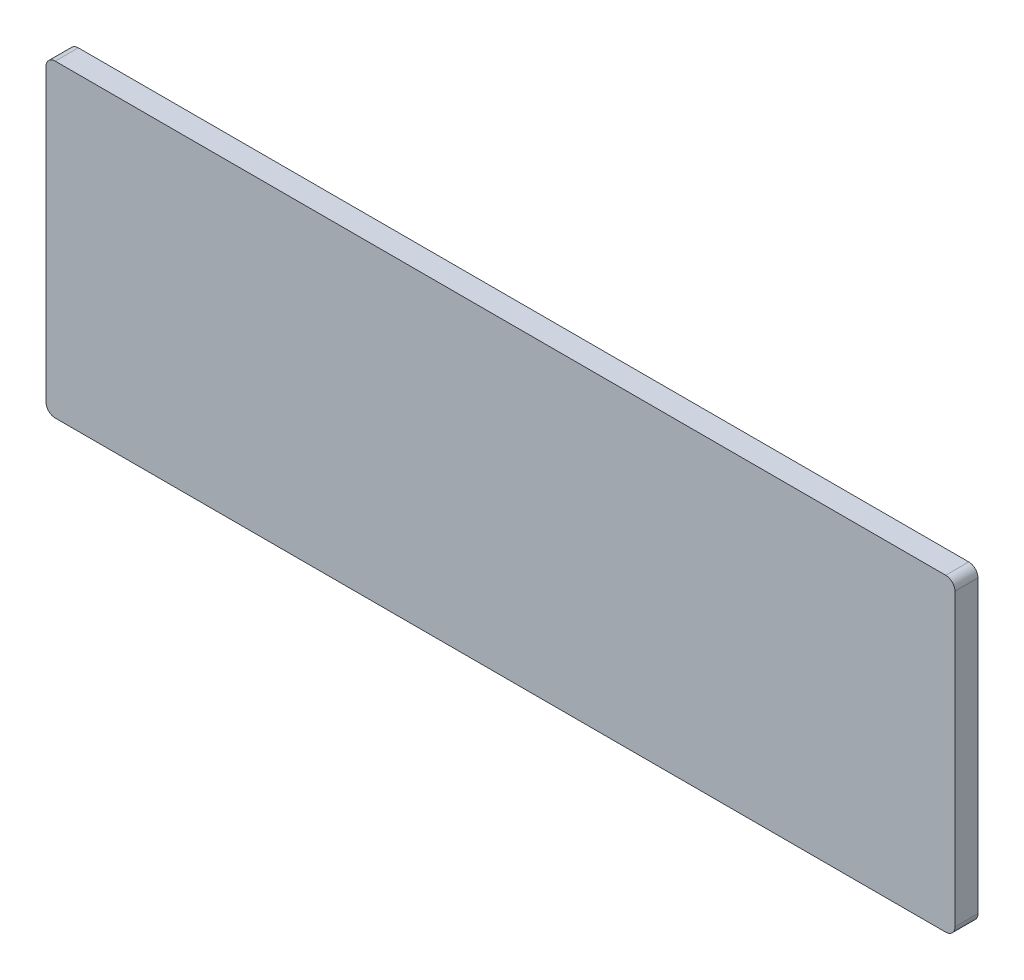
ISO-10303-21;
HEADER;
FILE_DESCRIPTION(('STEP AP214'),'2;1');
FILE_NAME('part.step','',(''),(''),'','','');
FILE_SCHEMA(('AUTOMOTIVE_DESIGN { 1 0 10303 214 1 1 1 1 }'));
ENDSEC;
DATA;
#1=APPLICATION_CONTEXT('core data for automotive mechanical design processes');
#2=APPLICATION_PROTOCOL_DEFINITION('international standard','automotive_design',2000,#1);
#3=PRODUCT_CONTEXT('',#1,'mechanical');
#4=PRODUCT('Part','Part','',(#3));
#5=PRODUCT_RELATED_PRODUCT_CATEGORY('part','',(#4));
#6=PRODUCT_DEFINITION_FORMATION('','',#4);
#7=PRODUCT_DEFINITION_CONTEXT('part definition',#1,'design');
#8=PRODUCT_DEFINITION('design','',#6,#7);
#9=PRODUCT_DEFINITION_SHAPE('','',#8);
#10=(LENGTH_UNIT() NAMED_UNIT(*) SI_UNIT(.MILLI.,.METRE.));
#11=(NAMED_UNIT(*) PLANE_ANGLE_UNIT() SI_UNIT($,.RADIAN.));
#12=(NAMED_UNIT(*) SI_UNIT($,.STERADIAN.) SOLID_ANGLE_UNIT());
#13=UNCERTAINTY_MEASURE_WITH_UNIT(LENGTH_MEASURE(1.E-05),#10,'distance_accuracy_value','');
#14=(GEOMETRIC_REPRESENTATION_CONTEXT(3) GLOBAL_UNCERTAINTY_ASSIGNED_CONTEXT((#13)) GLOBAL_UNIT_ASSIGNED_CONTEXT((#10,
#11,#12)) REPRESENTATION_CONTEXT('',''));
#15=CARTESIAN_POINT('',(0.,0.,0.));
#16=DIRECTION('',(0.,0.,1.));
#17=DIRECTION('',(1.,0.,0.));
#18=AXIS2_PLACEMENT_3D('',#15,#16,#17);
#19=CARTESIAN_POINT('',(0.,0.,5.));
#20=DIRECTION('',(1.,0.,0.));
#21=DIRECTION('',(0.,1.,0.));
#22=AXIS2_PLACEMENT_3D('',#19,#20,#21);
#23=PLANE('',#22);
#24=DIRECTION('',(0.,-1.,0.));
#25=VECTOR('',#24,1.);
#26=CARTESIAN_POINT('',(0.,0.,0.));
#27=LINE('',#26,#25);
#28=CARTESIAN_POINT('',(0.,64.9999999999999,0.));
#29=VERTEX_POINT('',#28);
#30=CARTESIAN_POINT('',(0.,2.,0.));
#31=VERTEX_POINT('',#30);
#32=EDGE_CURVE('E132',#29,#31,#27,.T.);
#33=ORIENTED_EDGE('',*,*,#32,.T.);
#34=DIRECTION('',(0.,0.,-1.));
#35=VECTOR('',#34,1.);
#36=CARTESIAN_POINT('',(0.,2.,5.));
#37=LINE('',#36,#35);
#38=CARTESIAN_POINT('',(0.,2.,5.));
#39=VERTEX_POINT('',#38);
#40=EDGE_CURVE('E155',#31,#39,#37,.F.);
#41=ORIENTED_EDGE('',*,*,#40,.T.);
#42=DIRECTION('',(0.,-1.,0.));
#43=VECTOR('',#42,1.);
#44=CARTESIAN_POINT('',(0.,0.,5.));
#45=LINE('',#44,#43);
#46=CARTESIAN_POINT('',(0.,64.9999999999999,5.));
#47=VERTEX_POINT('',#46);
#48=EDGE_CURVE('E130',#47,#39,#45,.T.);
#49=ORIENTED_EDGE('',*,*,#48,.F.);
#50=DIRECTION('',(0.,0.,-1.));
#51=VECTOR('',#50,1.);
#52=CARTESIAN_POINT('',(0.,64.9999999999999,5.));
#53=LINE('',#52,#51);
#54=EDGE_CURVE('E152',#47,#29,#53,.T.);
#55=ORIENTED_EDGE('',*,*,#54,.T.);
#56=EDGE_LOOP('',(#33,#41,#49,#55));
#57=FACE_BOUND('',#56,.T.);
#58=ADVANCED_FACE('F37',(#57),#23,.F.);
#59=CARTESIAN_POINT('',(0.,0.,5.));
#60=DIRECTION('',(0.,1.,0.));
#61=DIRECTION('',(-1.,0.,0.));
#62=AXIS2_PLACEMENT_3D('',#59,#60,#61);
#63=PLANE('',#62);
#64=DIRECTION('',(1.,0.,0.));
#65=VECTOR('',#64,1.);
#66=CARTESIAN_POINT('',(0.,0.,0.));
#67=LINE('',#66,#65);
#68=CARTESIAN_POINT('',(2.,0.,0.));
#69=VERTEX_POINT('',#68);
#70=CARTESIAN_POINT('',(195.,0.,0.));
#71=VERTEX_POINT('',#70);
#72=EDGE_CURVE('E128',#69,#71,#67,.T.);
#73=ORIENTED_EDGE('',*,*,#72,.T.);
#74=DIRECTION('',(0.,0.,-1.));
#75=VECTOR('',#74,1.);
#76=CARTESIAN_POINT('',(195.,0.,5.));
#77=LINE('',#76,#75);
#78=CARTESIAN_POINT('',(195.,0.,5.));
#79=VERTEX_POINT('',#78);
#80=EDGE_CURVE('E107',#71,#79,#77,.F.);
#81=ORIENTED_EDGE('',*,*,#80,.T.);
#82=DIRECTION('',(1.,0.,0.));
#83=VECTOR('',#82,1.);
#84=CARTESIAN_POINT('',(0.,0.,5.));
#85=LINE('',#84,#83);
#86=CARTESIAN_POINT('',(2.,0.,5.));
#87=VERTEX_POINT('',#86);
#88=EDGE_CURVE('E171',#87,#79,#85,.T.);
#89=ORIENTED_EDGE('',*,*,#88,.F.);
#90=DIRECTION('',(0.,0.,-1.));
#91=VECTOR('',#90,1.);
#92=CARTESIAN_POINT('',(2.,0.,5.));
#93=LINE('',#92,#91);
#94=EDGE_CURVE('E112',#87,#69,#93,.T.);
#95=ORIENTED_EDGE('',*,*,#94,.T.);
#96=EDGE_LOOP('',(#73,#81,#89,#95));
#97=FACE_BOUND('',#96,.T.);
#98=ADVANCED_FACE('F188',(#97),#63,.F.);
#99=CARTESIAN_POINT('',(197.,0.,5.));
#100=DIRECTION('',(-1.,0.,0.));
#101=DIRECTION('',(0.,0.,1.));
#102=AXIS2_PLACEMENT_3D('',#99,#100,#101);
#103=PLANE('',#102);
#104=DIRECTION('',(0.,1.,0.));
#105=VECTOR('',#104,1.);
#106=CARTESIAN_POINT('',(197.,0.,5.));
#107=LINE('',#106,#105);
#108=CARTESIAN_POINT('',(197.,2.00000000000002,5.));
#109=VERTEX_POINT('',#108);
#110=CARTESIAN_POINT('',(197.,65.,5.));
#111=VERTEX_POINT('',#110);
#112=EDGE_CURVE('E121',#109,#111,#107,.T.);
#113=ORIENTED_EDGE('',*,*,#112,.F.);
#114=DIRECTION('',(0.,0.,-1.));
#115=VECTOR('',#114,1.);
#116=CARTESIAN_POINT('',(197.,2.00000000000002,5.));
#117=LINE('',#116,#115);
#118=CARTESIAN_POINT('',(197.,2.00000000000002,0.));
#119=VERTEX_POINT('',#118);
#120=EDGE_CURVE('E106',#109,#119,#117,.T.);
#121=ORIENTED_EDGE('',*,*,#120,.T.);
#122=DIRECTION('',(0.,1.,0.));
#123=VECTOR('',#122,1.);
#124=CARTESIAN_POINT('',(197.,0.,0.));
#125=LINE('',#124,#123);
#126=CARTESIAN_POINT('',(197.,65.,0.));
#127=VERTEX_POINT('',#126);
#128=EDGE_CURVE('E119',#119,#127,#125,.T.);
#129=ORIENTED_EDGE('',*,*,#128,.T.);
#130=DIRECTION('',(0.,0.,-1.));
#131=VECTOR('',#130,1.);
#132=CARTESIAN_POINT('',(197.,65.,5.));
#133=LINE('',#132,#131);
#134=EDGE_CURVE('E123',#127,#111,#133,.F.);
#135=ORIENTED_EDGE('',*,*,#134,.T.);
#136=EDGE_LOOP('',(#113,#121,#129,#135));
#137=FACE_BOUND('',#136,.T.);
#138=ADVANCED_FACE('F118',(#137),#103,.F.);
#139=CARTESIAN_POINT('',(0.,66.9999999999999,5.));
#140=DIRECTION('',(0.,-1.,0.));
#141=DIRECTION('',(1.,0.,0.));
#142=AXIS2_PLACEMENT_3D('',#139,#140,#141);
#143=PLANE('',#142);
#144=DIRECTION('',(-1.,0.,0.));
#145=VECTOR('',#144,1.);
#146=CARTESIAN_POINT('',(0.,66.9999999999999,0.));
#147=LINE('',#146,#145);
#148=CARTESIAN_POINT('',(195.,67.,0.));
#149=VERTEX_POINT('',#148);
#150=CARTESIAN_POINT('',(1.99999999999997,66.9999999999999,0.));
#151=VERTEX_POINT('',#150);
#152=EDGE_CURVE('E127',#149,#151,#147,.T.);
#153=ORIENTED_EDGE('',*,*,#152,.T.);
#154=DIRECTION('',(0.,0.,-1.));
#155=VECTOR('',#154,1.);
#156=CARTESIAN_POINT('',(1.99999999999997,66.9999999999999,5.));
#157=LINE('',#156,#155);
#158=CARTESIAN_POINT('',(1.99999999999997,66.9999999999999,5.));
#159=VERTEX_POINT('',#158);
#160=EDGE_CURVE('E11',#151,#159,#157,.F.);
#161=ORIENTED_EDGE('',*,*,#160,.T.);
#162=DIRECTION('',(-1.,0.,0.));
#163=VECTOR('',#162,1.);
#164=CARTESIAN_POINT('',(0.,66.9999999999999,5.));
#165=LINE('',#164,#163);
#166=CARTESIAN_POINT('',(195.,67.,5.));
#167=VERTEX_POINT('',#166);
#168=EDGE_CURVE('E136',#167,#159,#165,.T.);
#169=ORIENTED_EDGE('',*,*,#168,.F.);
#170=DIRECTION('',(0.,0.,-1.));
#171=VECTOR('',#170,1.);
#172=CARTESIAN_POINT('',(195.,67.,5.));
#173=LINE('',#172,#171);
#174=EDGE_CURVE('E45',#167,#149,#173,.T.);
#175=ORIENTED_EDGE('',*,*,#174,.T.);
#176=EDGE_LOOP('',(#153,#161,#169,#175));
#177=FACE_BOUND('',#176,.T.);
#178=ADVANCED_FACE('F158',(#177),#143,.F.);
#179=CARTESIAN_POINT('',(0.,0.,5.));
#180=DIRECTION('',(0.,0.,-1.));
#181=DIRECTION('',(-1.,0.,0.));
#182=AXIS2_PLACEMENT_3D('',#179,#180,#181);
#183=PLANE('',#182);
#184=ORIENTED_EDGE('',*,*,#88,.T.);
#185=CARTESIAN_POINT('',(195.,2.00000000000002,5.));
#186=DIRECTION('',(0.,0.,-1.));
#187=DIRECTION('',(-1.,0.,0.));
#188=AXIS2_PLACEMENT_3D('',#185,#186,#187);
#189=CIRCLE('',#188,2.);
#190=EDGE_CURVE('E150',#79,#109,#189,.F.);
#191=ORIENTED_EDGE('',*,*,#190,.T.);
#192=ORIENTED_EDGE('',*,*,#112,.T.);
#193=CARTESIAN_POINT('',(195.,65.,5.));
#194=DIRECTION('',(0.,0.,-1.));
#195=DIRECTION('',(-1.,0.,0.));
#196=AXIS2_PLACEMENT_3D('',#193,#194,#195);
#197=CIRCLE('',#196,2.);
#198=EDGE_CURVE('E57',#111,#167,#197,.F.);
#199=ORIENTED_EDGE('',*,*,#198,.T.);
#200=ORIENTED_EDGE('',*,*,#168,.T.);
#201=CARTESIAN_POINT('',(1.99999999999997,64.9999999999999,5.));
#202=DIRECTION('',(0.,0.,-1.));
#203=DIRECTION('',(-1.,0.,0.));
#204=AXIS2_PLACEMENT_3D('',#201,#202,#203);
#205=CIRCLE('',#204,2.);
#206=EDGE_CURVE('E146',#159,#47,#205,.F.);
#207=ORIENTED_EDGE('',*,*,#206,.T.);
#208=ORIENTED_EDGE('',*,*,#48,.T.);
#209=CARTESIAN_POINT('',(2.,2.,5.));
#210=DIRECTION('',(0.,0.,-1.));
#211=DIRECTION('',(-1.,0.,0.));
#212=AXIS2_PLACEMENT_3D('',#209,#210,#211);
#213=CIRCLE('',#212,2.);
#214=EDGE_CURVE('E148',#39,#87,#213,.F.);
#215=ORIENTED_EDGE('',*,*,#214,.T.);
#216=EDGE_LOOP('',(#184,#191,#192,#199,#200,#207,#208,#215));
#217=FACE_BOUND('',#216,.T.);
#218=ADVANCED_FACE('F177',(#217),#183,.F.);
#219=CARTESIAN_POINT('',(0.,0.,0.));
#220=DIRECTION('',(0.,0.,-1.));
#221=DIRECTION('',(-1.,0.,0.));
#222=AXIS2_PLACEMENT_3D('',#219,#220,#221);
#223=PLANE('',#222);
#224=ORIENTED_EDGE('',*,*,#128,.F.);
#225=CARTESIAN_POINT('',(195.,2.00000000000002,0.));
#226=DIRECTION('',(0.,0.,-1.));
#227=DIRECTION('',(-1.,0.,0.));
#228=AXIS2_PLACEMENT_3D('',#225,#226,#227);
#229=CIRCLE('',#228,2.);
#230=EDGE_CURVE('E102',#119,#71,#229,.T.);
#231=ORIENTED_EDGE('',*,*,#230,.T.);
#232=ORIENTED_EDGE('',*,*,#72,.F.);
#233=CARTESIAN_POINT('',(2.,2.,0.));
#234=DIRECTION('',(0.,0.,-1.));
#235=DIRECTION('',(-1.,0.,0.));
#236=AXIS2_PLACEMENT_3D('',#233,#234,#235);
#237=CIRCLE('',#236,2.);
#238=EDGE_CURVE('E113',#69,#31,#237,.T.);
#239=ORIENTED_EDGE('',*,*,#238,.T.);
#240=ORIENTED_EDGE('',*,*,#32,.F.);
#241=CARTESIAN_POINT('',(1.99999999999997,64.9999999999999,0.));
#242=DIRECTION('',(0.,0.,-1.));
#243=DIRECTION('',(-1.,0.,0.));
#244=AXIS2_PLACEMENT_3D('',#241,#242,#243);
#245=CIRCLE('',#244,2.);
#246=EDGE_CURVE('E139',#29,#151,#245,.T.);
#247=ORIENTED_EDGE('',*,*,#246,.T.);
#248=ORIENTED_EDGE('',*,*,#152,.F.);
#249=CARTESIAN_POINT('',(195.,65.,0.));
#250=DIRECTION('',(0.,0.,-1.));
#251=DIRECTION('',(-1.,0.,0.));
#252=AXIS2_PLACEMENT_3D('',#249,#250,#251);
#253=CIRCLE('',#252,2.);
#254=EDGE_CURVE('E122',#149,#127,#253,.T.);
#255=ORIENTED_EDGE('',*,*,#254,.T.);
#256=EDGE_LOOP('',(#224,#231,#232,#239,#240,#247,#248,#255));
#257=FACE_BOUND('',#256,.T.);
#258=ADVANCED_FACE('F125',(#257),#223,.T.);
#259=CARTESIAN_POINT('',(195.,2.00000000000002,5.));
#260=DIRECTION('',(0.,0.,-1.));
#261=DIRECTION('',(-1.,0.,0.));
#262=AXIS2_PLACEMENT_3D('',#259,#260,#261);
#263=CYLINDRICAL_SURFACE('',#262,2.);
#264=ORIENTED_EDGE('',*,*,#190,.F.);
#265=ORIENTED_EDGE('',*,*,#80,.F.);
#266=ORIENTED_EDGE('',*,*,#230,.F.);
#267=ORIENTED_EDGE('',*,*,#120,.F.);
#268=EDGE_LOOP('',(#264,#265,#266,#267));
#269=FACE_BOUND('',#268,.T.);
#270=ADVANCED_FACE('F105',(#269),#263,.T.);
#271=CARTESIAN_POINT('',(2.,2.,5.));
#272=DIRECTION('',(0.,0.,-1.));
#273=DIRECTION('',(-1.,0.,0.));
#274=AXIS2_PLACEMENT_3D('',#271,#272,#273);
#275=CYLINDRICAL_SURFACE('',#274,2.);
#276=ORIENTED_EDGE('',*,*,#214,.F.);
#277=ORIENTED_EDGE('',*,*,#40,.F.);
#278=ORIENTED_EDGE('',*,*,#238,.F.);
#279=ORIENTED_EDGE('',*,*,#94,.F.);
#280=EDGE_LOOP('',(#276,#277,#278,#279));
#281=FACE_BOUND('',#280,.T.);
#282=ADVANCED_FACE('F199',(#281),#275,.T.);
#283=CARTESIAN_POINT('',(1.99999999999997,64.9999999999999,5.));
#284=DIRECTION('',(0.,0.,-1.));
#285=DIRECTION('',(-1.,0.,0.));
#286=AXIS2_PLACEMENT_3D('',#283,#284,#285);
#287=CYLINDRICAL_SURFACE('',#286,2.);
#288=ORIENTED_EDGE('',*,*,#206,.F.);
#289=ORIENTED_EDGE('',*,*,#160,.F.);
#290=ORIENTED_EDGE('',*,*,#246,.F.);
#291=ORIENTED_EDGE('',*,*,#54,.F.);
#292=EDGE_LOOP('',(#288,#289,#290,#291));
#293=FACE_BOUND('',#292,.T.);
#294=ADVANCED_FACE('F165',(#293),#287,.T.);
#295=CARTESIAN_POINT('',(195.,65.,5.));
#296=DIRECTION('',(0.,0.,-1.));
#297=DIRECTION('',(-1.,0.,0.));
#298=AXIS2_PLACEMENT_3D('',#295,#296,#297);
#299=CYLINDRICAL_SURFACE('',#298,2.);
#300=ORIENTED_EDGE('',*,*,#198,.F.);
#301=ORIENTED_EDGE('',*,*,#134,.F.);
#302=ORIENTED_EDGE('',*,*,#254,.F.);
#303=ORIENTED_EDGE('',*,*,#174,.F.);
#304=EDGE_LOOP('',(#300,#301,#302,#303));
#305=FACE_BOUND('',#304,.T.);
#306=ADVANCED_FACE('F39',(#305),#299,.T.);
#307=CLOSED_SHELL('',(#58,#98,#138,#178,#218,#258,#270,#282,#294,#306));
#308=MANIFOLD_SOLID_BREP('B2',#307);
#309=ADVANCED_BREP_SHAPE_REPRESENTATION('',(#18,#308),#14);
#310=SHAPE_DEFINITION_REPRESENTATION(#9,#309);
ENDSEC;
END-ISO-10303-21;
